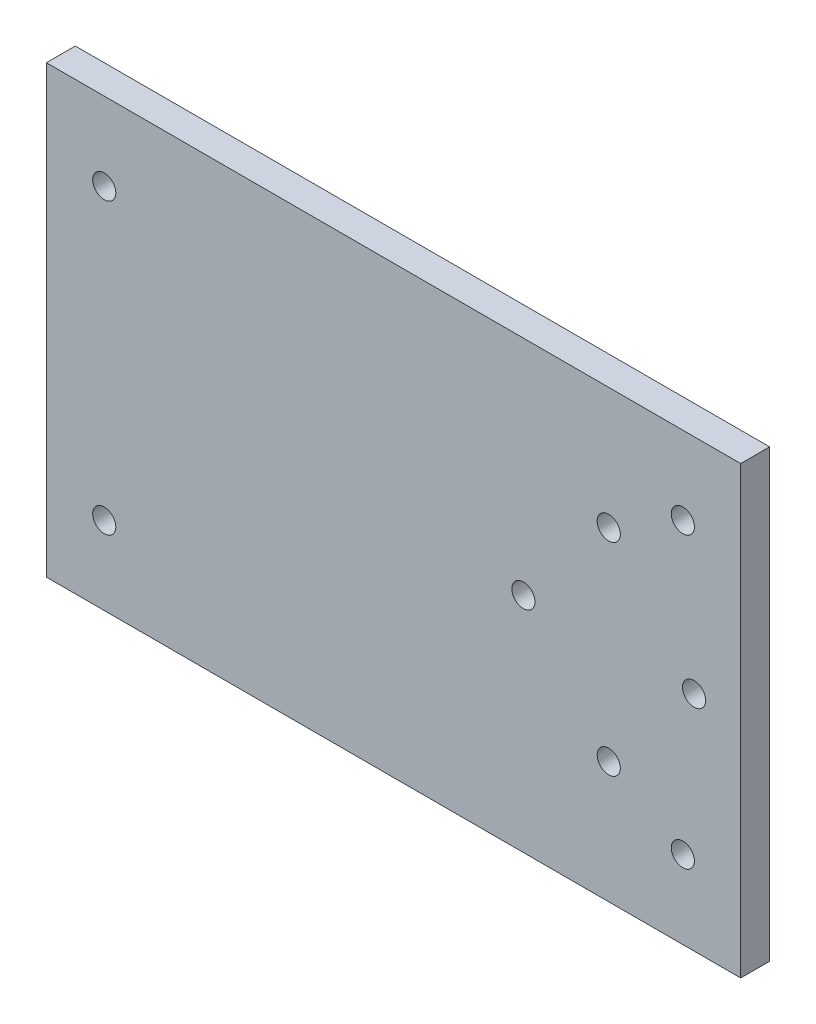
from build123d import *

# Parameters (mm, degrees)
ESQUISSE1_W             = 240
ESQUISSE1_H             = 154
BOSS_EXTRU_1_DEPTH      = 10
ESQUISSE2_R             = 4
ENL_V_MAT_EXTRU_1_DEPTH = 10
ESQUISSE3_R             = 4
ENL_V_MAT_EXTRU_2_DEPTH = 10
CHANFREIN1_SIZE         = 3


with BuildPart() as part:
    # Esquisse1 → Boss.-Extru.1 (new body)
    with BuildSketch(Plane.XY):
        with Locations((120, 77)):
            Rectangle(ESQUISSE1_W, ESQUISSE1_H)
    extrude(amount=BOSS_EXTRU_1_DEPTH)

    # Esquisse2 → Enl_v. mat.-Extru.1 (cut)
    with BuildSketch(Plane.XY.offset(10)):
        with Locations((20, 27)):
            Circle(ESQUISSE2_R)
        with Locations((20, 127)):
            Circle(ESQUISSE2_R)
        with Locations((220, 27)):
            Circle(ESQUISSE2_R)
        with Locations((220, 127)):
            Circle(ESQUISSE2_R)
    extrude(amount=-ENL_V_MAT_EXTRU_1_DEPTH, mode=Mode.SUBTRACT)

    # Esquisse3 → Enl_v. mat.-Extru.2 (cut)
    with BuildSketch(Plane.XY.offset(10)):
        with Locations((164.890000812, 77.009790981)):
            Circle(ESQUISSE3_R)
        with Locations((223.89, 77)):
            Circle(ESQUISSE3_R)
        with Locations((194.39, 112.009790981)):
            Circle(ESQUISSE3_R)
        with Locations((194.390000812, 42.009790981)):
            Circle(ESQUISSE3_R)
    extrude(amount=-ENL_V_MAT_EXTRU_2_DEPTH, mode=Mode.SUBTRACT)

    # Chanfrein1
    chanfrein1_edges = [part.edges().sort_by_distance(p)[0] for p in [
        (160.890000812, 77.009790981, 0),
        (219.89, 77, 0),
        (190.39, 112.009790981, 0),
        (190.390000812, 42.009790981, 0),
    ]]
    chamfer(chanfrein1_edges, length=CHANFREIN1_SIZE)


solid = part.part
